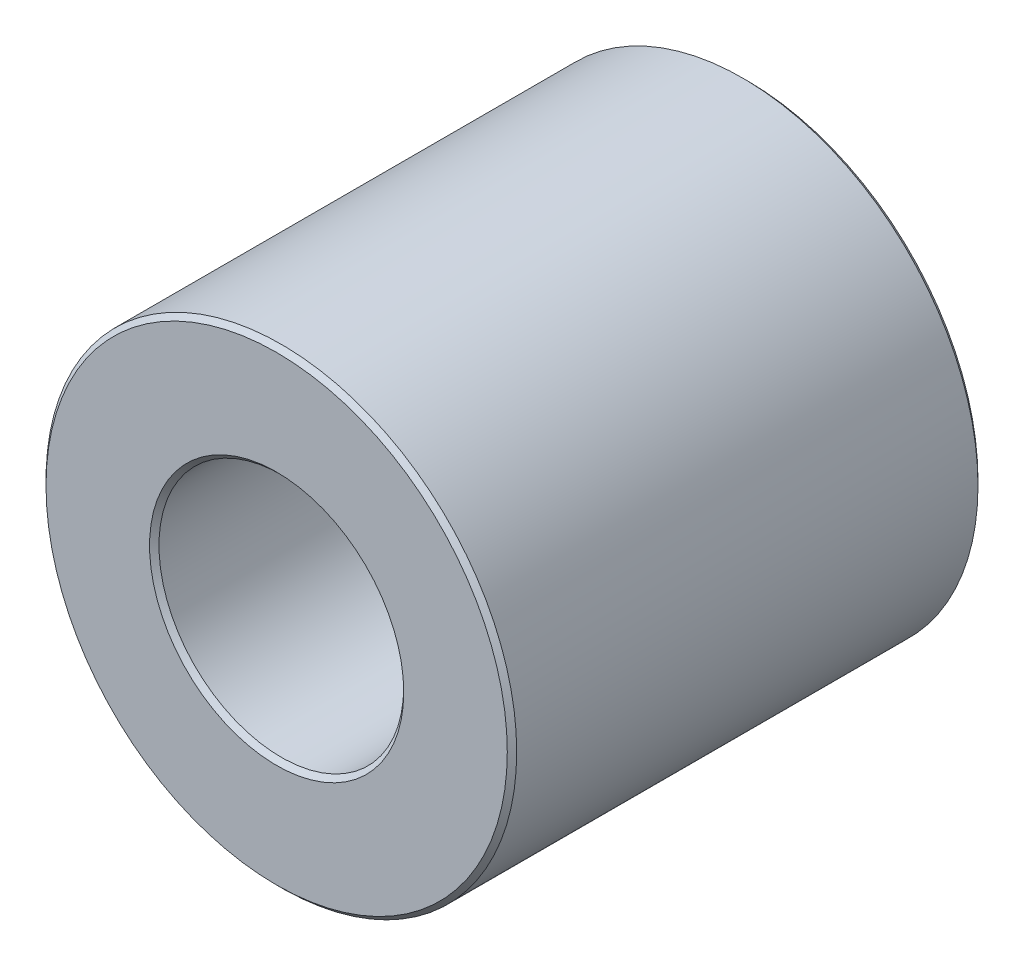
ISO-10303-21;
HEADER;
FILE_DESCRIPTION(('STEP AP214'),'2;1');
FILE_NAME('part.step','',(''),(''),'','','');
FILE_SCHEMA(('AUTOMOTIVE_DESIGN { 1 0 10303 214 1 1 1 1 }'));
ENDSEC;
DATA;
#1=APPLICATION_CONTEXT('core data for automotive mechanical design processes');
#2=APPLICATION_PROTOCOL_DEFINITION('international standard','automotive_design',2000,#1);
#3=PRODUCT_CONTEXT('',#1,'mechanical');
#4=PRODUCT('Part','Part','',(#3));
#5=PRODUCT_RELATED_PRODUCT_CATEGORY('part','',(#4));
#6=PRODUCT_DEFINITION_FORMATION('','',#4);
#7=PRODUCT_DEFINITION_CONTEXT('part definition',#1,'design');
#8=PRODUCT_DEFINITION('design','',#6,#7);
#9=PRODUCT_DEFINITION_SHAPE('','',#8);
#10=(LENGTH_UNIT() NAMED_UNIT(*) SI_UNIT(.MILLI.,.METRE.));
#11=(NAMED_UNIT(*) PLANE_ANGLE_UNIT() SI_UNIT($,.RADIAN.));
#12=(NAMED_UNIT(*) SI_UNIT($,.STERADIAN.) SOLID_ANGLE_UNIT());
#13=UNCERTAINTY_MEASURE_WITH_UNIT(LENGTH_MEASURE(1.E-05),#10,'distance_accuracy_value','');
#14=(GEOMETRIC_REPRESENTATION_CONTEXT(3) GLOBAL_UNCERTAINTY_ASSIGNED_CONTEXT((#13)) GLOBAL_UNIT_ASSIGNED_CONTEXT((#10,
#11,#12)) REPRESENTATION_CONTEXT('',''));
#15=CARTESIAN_POINT('',(0.,0.,0.));
#16=DIRECTION('',(0.,0.,1.));
#17=DIRECTION('',(1.,0.,0.));
#18=AXIS2_PLACEMENT_3D('',#15,#16,#17);
#19=CARTESIAN_POINT('',(0.,0.,5.));
#20=DIRECTION('',(0.,0.,1.));
#21=DIRECTION('',(1.,0.,0.));
#22=AXIS2_PLACEMENT_3D('',#19,#20,#21);
#23=PLANE('',#22);
#24=CARTESIAN_POINT('',(0.,0.,5.));
#25=DIRECTION('',(0.,0.,1.));
#26=DIRECTION('',(1.,0.,0.));
#27=AXIS2_PLACEMENT_3D('',#24,#25,#26);
#28=CIRCLE('',#27,2.7);
#29=CARTESIAN_POINT('',(2.7,0.,5.));
#30=VERTEX_POINT('',#29);
#31=EDGE_CURVE('E10',#30,#30,#28,.F.);
#32=ORIENTED_EDGE('',*,*,#31,.T.);
#33=EDGE_LOOP('',(#32));
#34=FACE_BOUND('',#33,.T.);
#35=CARTESIAN_POINT('',(0.,0.,5.));
#36=DIRECTION('',(0.,0.,1.));
#37=DIRECTION('',(1.,0.,0.));
#38=AXIS2_PLACEMENT_3D('',#35,#36,#37);
#39=CIRCLE('',#38,4.9);
#40=CARTESIAN_POINT('',(4.9,0.,5.));
#41=VERTEX_POINT('',#40);
#42=EDGE_CURVE('E45',#41,#41,#39,.T.);
#43=ORIENTED_EDGE('',*,*,#42,.T.);
#44=EDGE_LOOP('',(#43));
#45=FACE_BOUND('',#44,.T.);
#46=ADVANCED_FACE('F37',(#34,#45),#23,.T.);
#47=CARTESIAN_POINT('',(0.,0.,-5.));
#48=DIRECTION('',(0.,0.,1.));
#49=DIRECTION('',(1.,0.,0.));
#50=AXIS2_PLACEMENT_3D('',#47,#48,#49);
#51=PLANE('',#50);
#52=CARTESIAN_POINT('',(0.,0.,-5.));
#53=DIRECTION('',(0.,0.,1.));
#54=DIRECTION('',(1.,0.,0.));
#55=AXIS2_PLACEMENT_3D('',#52,#53,#54);
#56=CIRCLE('',#55,4.9);
#57=CARTESIAN_POINT('',(4.9,0.,-5.));
#58=VERTEX_POINT('',#57);
#59=EDGE_CURVE('E64',#58,#58,#56,.F.);
#60=ORIENTED_EDGE('',*,*,#59,.T.);
#61=EDGE_LOOP('',(#60));
#62=FACE_BOUND('',#61,.T.);
#63=CARTESIAN_POINT('',(0.,0.,-5.));
#64=DIRECTION('',(0.,0.,1.));
#65=DIRECTION('',(1.,0.,0.));
#66=AXIS2_PLACEMENT_3D('',#63,#64,#65);
#67=CIRCLE('',#66,2.7);
#68=CARTESIAN_POINT('',(2.7,0.,-5.));
#69=VERTEX_POINT('',#68);
#70=EDGE_CURVE('E67',#69,#69,#67,.T.);
#71=ORIENTED_EDGE('',*,*,#70,.T.);
#72=EDGE_LOOP('',(#71));
#73=FACE_BOUND('',#72,.T.);
#74=ADVANCED_FACE('F89',(#62,#73),#51,.F.);
#75=CARTESIAN_POINT('',(0.,0.,5.));
#76=DIRECTION('',(0.,0.,-1.));
#77=DIRECTION('',(-1.,0.,0.));
#78=AXIS2_PLACEMENT_3D('',#75,#76,#77);
#79=CYLINDRICAL_SURFACE('',#78,5.);
#80=CARTESIAN_POINT('',(0.,0.,-4.9));
#81=DIRECTION('',(0.,0.,1.));
#82=DIRECTION('',(1.,0.,0.));
#83=AXIS2_PLACEMENT_3D('',#80,#81,#82);
#84=CIRCLE('',#83,5.);
#85=CARTESIAN_POINT('',(5.,0.,-4.9));
#86=VERTEX_POINT('',#85);
#87=EDGE_CURVE('E70',#86,#86,#84,.T.);
#88=ORIENTED_EDGE('',*,*,#87,.T.);
#89=EDGE_LOOP('',(#88));
#90=FACE_BOUND('',#89,.T.);
#91=CARTESIAN_POINT('',(0.,0.,4.9));
#92=DIRECTION('',(0.,0.,1.));
#93=DIRECTION('',(1.,0.,0.));
#94=AXIS2_PLACEMENT_3D('',#91,#92,#93);
#95=CIRCLE('',#94,5.);
#96=CARTESIAN_POINT('',(5.,0.,4.9));
#97=VERTEX_POINT('',#96);
#98=EDGE_CURVE('E73',#97,#97,#95,.F.);
#99=ORIENTED_EDGE('',*,*,#98,.T.);
#100=EDGE_LOOP('',(#99));
#101=FACE_BOUND('',#100,.T.);
#102=ADVANCED_FACE('F78',(#90,#101),#79,.T.);
#103=CARTESIAN_POINT('',(0.,0.,5.));
#104=DIRECTION('',(0.,0.,-1.));
#105=DIRECTION('',(-1.,0.,0.));
#106=AXIS2_PLACEMENT_3D('',#103,#104,#105);
#107=CYLINDRICAL_SURFACE('',#106,2.6);
#108=CARTESIAN_POINT('',(0.,0.,-4.9));
#109=DIRECTION('',(0.,0.,1.));
#110=DIRECTION('',(1.,0.,0.));
#111=AXIS2_PLACEMENT_3D('',#108,#109,#110);
#112=CIRCLE('',#111,2.6);
#113=CARTESIAN_POINT('',(2.6,0.,-4.9));
#114=VERTEX_POINT('',#113);
#115=EDGE_CURVE('E52',#114,#114,#112,.F.);
#116=ORIENTED_EDGE('',*,*,#115,.T.);
#117=EDGE_LOOP('',(#116));
#118=FACE_BOUND('',#117,.T.);
#119=CARTESIAN_POINT('',(0.,0.,4.9));
#120=DIRECTION('',(0.,0.,1.));
#121=DIRECTION('',(1.,0.,0.));
#122=AXIS2_PLACEMENT_3D('',#119,#120,#121);
#123=CIRCLE('',#122,2.6);
#124=CARTESIAN_POINT('',(2.6,0.,4.9));
#125=VERTEX_POINT('',#124);
#126=EDGE_CURVE('E58',#125,#125,#123,.T.);
#127=ORIENTED_EDGE('',*,*,#126,.T.);
#128=EDGE_LOOP('',(#127));
#129=FACE_BOUND('',#128,.T.);
#130=ADVANCED_FACE('F97',(#118,#129),#107,.F.);
#131=CARTESIAN_POINT('',(0.,0.,-4.9));
#132=DIRECTION('',(0.,0.,1.));
#133=DIRECTION('',(1.,0.,0.));
#134=AXIS2_PLACEMENT_3D('',#131,#132,#133);
#135=CONICAL_SURFACE('',#134,5.,0.785398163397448);
#136=ORIENTED_EDGE('',*,*,#59,.F.);
#137=EDGE_LOOP('',(#136));
#138=FACE_BOUND('',#137,.T.);
#139=ORIENTED_EDGE('',*,*,#87,.F.);
#140=EDGE_LOOP('',(#139));
#141=FACE_BOUND('',#140,.T.);
#142=ADVANCED_FACE('F102',(#138,#141),#135,.T.);
#143=CARTESIAN_POINT('',(0.,0.,-5.));
#144=DIRECTION('',(0.,0.,-1.));
#145=DIRECTION('',(-1.,0.,0.));
#146=AXIS2_PLACEMENT_3D('',#143,#144,#145);
#147=CONICAL_SURFACE('',#146,2.7,0.785398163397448);
#148=ORIENTED_EDGE('',*,*,#115,.F.);
#149=EDGE_LOOP('',(#148));
#150=FACE_BOUND('',#149,.T.);
#151=ORIENTED_EDGE('',*,*,#70,.F.);
#152=EDGE_LOOP('',(#151));
#153=FACE_BOUND('',#152,.T.);
#154=ADVANCED_FACE('F86',(#150,#153),#147,.F.);
#155=CARTESIAN_POINT('',(0.,0.,4.9));
#156=DIRECTION('',(0.,0.,1.));
#157=DIRECTION('',(1.,0.,0.));
#158=AXIS2_PLACEMENT_3D('',#155,#156,#157);
#159=CONICAL_SURFACE('',#158,2.6,0.78539816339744);
#160=ORIENTED_EDGE('',*,*,#31,.F.);
#161=EDGE_LOOP('',(#160));
#162=FACE_BOUND('',#161,.T.);
#163=ORIENTED_EDGE('',*,*,#126,.F.);
#164=EDGE_LOOP('',(#163));
#165=FACE_BOUND('',#164,.T.);
#166=ADVANCED_FACE('F82',(#162,#165),#159,.F.);
#167=CARTESIAN_POINT('',(0.,0.,5.));
#168=DIRECTION('',(0.,0.,-1.));
#169=DIRECTION('',(-1.,0.,0.));
#170=AXIS2_PLACEMENT_3D('',#167,#168,#169);
#171=CONICAL_SURFACE('',#170,4.9,0.785398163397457);
#172=ORIENTED_EDGE('',*,*,#98,.F.);
#173=EDGE_LOOP('',(#172));
#174=FACE_BOUND('',#173,.T.);
#175=ORIENTED_EDGE('',*,*,#42,.F.);
#176=EDGE_LOOP('',(#175));
#177=FACE_BOUND('',#176,.T.);
#178=ADVANCED_FACE('F39',(#174,#177),#171,.T.);
#179=CLOSED_SHELL('',(#46,#74,#102,#130,#142,#154,#166,#178));
#180=MANIFOLD_SOLID_BREP('B2',#179);
#181=ADVANCED_BREP_SHAPE_REPRESENTATION('',(#18,#180),#14);
#182=SHAPE_DEFINITION_REPRESENTATION(#9,#181);
ENDSEC;
END-ISO-10303-21;
